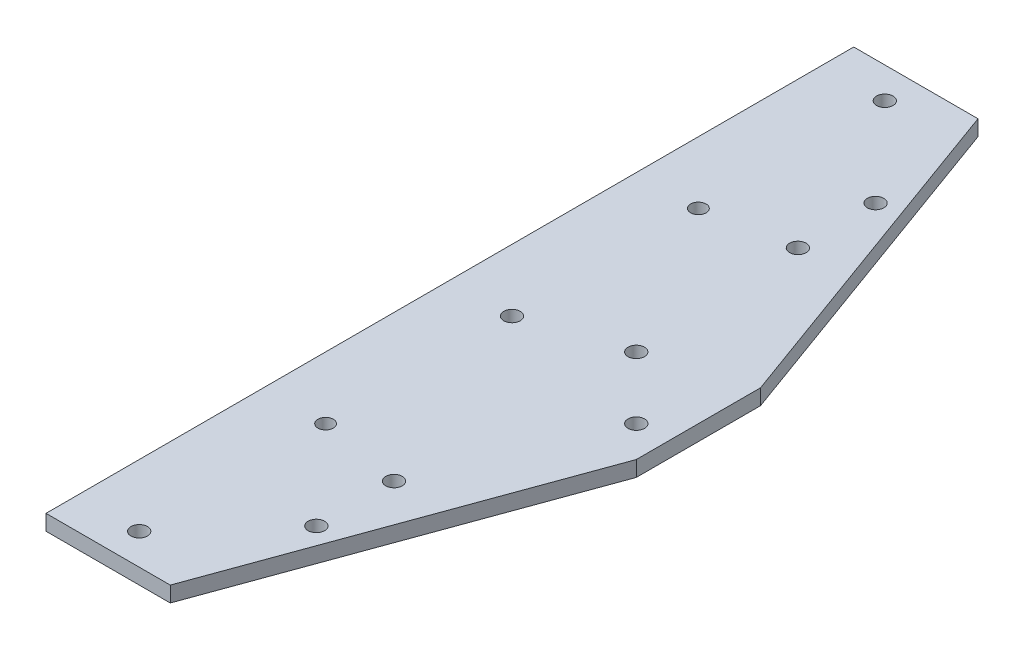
ISO-10303-21;
HEADER;
FILE_DESCRIPTION(('STEP AP214'),'2;1');
FILE_NAME('part.step','',(''),(''),'','','');
FILE_SCHEMA(('AUTOMOTIVE_DESIGN { 1 0 10303 214 1 1 1 1 }'));
ENDSEC;
DATA;
#1=APPLICATION_CONTEXT('core data for automotive mechanical design processes');
#2=APPLICATION_PROTOCOL_DEFINITION('international standard','automotive_design',2000,#1);
#3=PRODUCT_CONTEXT('',#1,'mechanical');
#4=PRODUCT('Part','Part','',(#3));
#5=PRODUCT_RELATED_PRODUCT_CATEGORY('part','',(#4));
#6=PRODUCT_DEFINITION_FORMATION('','',#4);
#7=PRODUCT_DEFINITION_CONTEXT('part definition',#1,'design');
#8=PRODUCT_DEFINITION('design','',#6,#7);
#9=PRODUCT_DEFINITION_SHAPE('','',#8);
#10=(LENGTH_UNIT() NAMED_UNIT(*) SI_UNIT(.MILLI.,.METRE.));
#11=(NAMED_UNIT(*) PLANE_ANGLE_UNIT() SI_UNIT($,.RADIAN.));
#12=(NAMED_UNIT(*) SI_UNIT($,.STERADIAN.) SOLID_ANGLE_UNIT());
#13=UNCERTAINTY_MEASURE_WITH_UNIT(LENGTH_MEASURE(1.E-05),#10,'distance_accuracy_value','');
#14=(GEOMETRIC_REPRESENTATION_CONTEXT(3) GLOBAL_UNCERTAINTY_ASSIGNED_CONTEXT((#13)) GLOBAL_UNIT_ASSIGNED_CONTEXT((#10,
#11,#12)) REPRESENTATION_CONTEXT('',''));
#15=CARTESIAN_POINT('',(0.,0.,0.));
#16=DIRECTION('',(0.,0.,1.));
#17=DIRECTION('',(1.,0.,0.));
#18=AXIS2_PLACEMENT_3D('',#15,#16,#17);
#19=CARTESIAN_POINT('',(0.,6.35,139.7));
#20=DIRECTION('',(0.,1.,0.));
#21=DIRECTION('',(0.,0.,1.));
#22=AXIS2_PLACEMENT_3D('',#19,#20,#21);
#23=PLANE('',#22);
#24=CARTESIAN_POINT('',(59.7232209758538,6.35,57.15));
#25=DIRECTION('',(0.,1.,0.));
#26=DIRECTION('',(0.,0.,-1.));
#27=AXIS2_PLACEMENT_3D('',#24,#25,#26);
#28=CIRCLE('',#27,3.37312);
#29=CARTESIAN_POINT('',(59.7232209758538,6.35,53.77688));
#30=VERTEX_POINT('',#29);
#31=EDGE_CURVE('E205',#30,#30,#28,.T.);
#32=ORIENTED_EDGE('',*,*,#31,.F.);
#33=EDGE_LOOP('',(#32));
#34=FACE_BOUND('',#33,.T.);
#35=CARTESIAN_POINT('',(25.4,6.35,50.8));
#36=DIRECTION('',(0.,1.,0.));
#37=DIRECTION('',(0.,0.,1.));
#38=AXIS2_PLACEMENT_3D('',#35,#36,#37);
#39=CIRCLE('',#38,3.154378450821);
#40=CARTESIAN_POINT('',(25.4,6.35,53.954378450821));
#41=VERTEX_POINT('',#40);
#42=EDGE_CURVE('E199',#41,#41,#39,.T.);
#43=ORIENTED_EDGE('',*,*,#42,.F.);
#44=EDGE_LOOP('',(#43));
#45=FACE_BOUND('',#44,.T.);
#46=CARTESIAN_POINT('',(59.7232209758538,6.35,88.9));
#47=DIRECTION('',(0.,1.,0.));
#48=DIRECTION('',(0.,0.,-1.));
#49=AXIS2_PLACEMENT_3D('',#46,#47,#48);
#50=CIRCLE('',#49,3.37312000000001);
#51=CARTESIAN_POINT('',(59.7232209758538,6.35,85.52688));
#52=VERTEX_POINT('',#51);
#53=EDGE_CURVE('E193',#52,#52,#50,.T.);
#54=ORIENTED_EDGE('',*,*,#53,.F.);
#55=EDGE_LOOP('',(#54));
#56=FACE_BOUND('',#55,.T.);
#57=CARTESIAN_POINT('',(59.7232209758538,6.35,-139.7));
#58=DIRECTION('',(0.,1.,0.));
#59=DIRECTION('',(0.,0.,1.));
#60=AXIS2_PLACEMENT_3D('',#57,#58,#59);
#61=CIRCLE('',#60,3.37312000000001);
#62=CARTESIAN_POINT('',(59.7232209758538,6.35,-136.32688));
#63=VERTEX_POINT('',#62);
#64=EDGE_CURVE('E187',#63,#63,#61,.T.);
#65=ORIENTED_EDGE('',*,*,#64,.F.);
#66=EDGE_LOOP('',(#65));
#67=FACE_BOUND('',#66,.T.);
#68=CARTESIAN_POINT('',(25.4,6.35,-101.6));
#69=DIRECTION('',(0.,1.,0.));
#70=DIRECTION('',(0.,0.,-1.));
#71=AXIS2_PLACEMENT_3D('',#68,#69,#70);
#72=CIRCLE('',#71,3.154378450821);
#73=CARTESIAN_POINT('',(25.4,6.35,-104.754378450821));
#74=VERTEX_POINT('',#73);
#75=EDGE_CURVE('E181',#74,#74,#72,.T.);
#76=ORIENTED_EDGE('',*,*,#75,.F.);
#77=EDGE_LOOP('',(#76));
#78=FACE_BOUND('',#77,.T.);
#79=CARTESIAN_POINT('',(59.7232209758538,6.35,-107.95));
#80=DIRECTION('',(0.,1.,0.));
#81=DIRECTION('',(0.,0.,1.));
#82=AXIS2_PLACEMENT_3D('',#79,#80,#81);
#83=CIRCLE('',#82,3.37312000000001);
#84=CARTESIAN_POINT('',(59.7232209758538,6.35,-104.57688));
#85=VERTEX_POINT('',#84);
#86=EDGE_CURVE('E175',#85,#85,#83,.T.);
#87=ORIENTED_EDGE('',*,*,#86,.F.);
#88=EDGE_LOOP('',(#87));
#89=FACE_BOUND('',#88,.T.);
#90=CARTESIAN_POINT('',(63.4999999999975,6.35,-38.1010753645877));
#91=DIRECTION('',(0.,1.,0.));
#92=DIRECTION('',(0.,0.,1.));
#93=AXIS2_PLACEMENT_3D('',#90,#91,#92);
#94=CIRCLE('',#93,3.37312);
#95=CARTESIAN_POINT('',(63.4999999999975,6.35,-34.7279553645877));
#96=VERTEX_POINT('',#95);
#97=EDGE_CURVE('E160',#96,#96,#94,.T.);
#98=ORIENTED_EDGE('',*,*,#97,.F.);
#99=EDGE_LOOP('',(#98));
#100=FACE_BOUND('',#99,.T.);
#101=CARTESIAN_POINT('',(25.4,6.35,-177.8));
#102=DIRECTION('',(0.,1.,0.));
#103=DIRECTION('',(0.,0.,1.));
#104=AXIS2_PLACEMENT_3D('',#101,#102,#103);
#105=CIRCLE('',#104,3.37311999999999);
#106=CARTESIAN_POINT('',(25.4,6.35,-174.42688));
#107=VERTEX_POINT('',#106);
#108=EDGE_CURVE('E148',#107,#107,#105,.T.);
#109=ORIENTED_EDGE('',*,*,#108,.F.);
#110=EDGE_LOOP('',(#109));
#111=FACE_BOUND('',#110,.T.);
#112=DIRECTION('',(0.,0.,1.));
#113=VECTOR('',#112,1.);
#114=CARTESIAN_POINT('',(0.,6.35,0.));
#115=LINE('',#114,#113);
#116=CARTESIAN_POINT('',(0.,6.35,-190.5));
#117=VERTEX_POINT('',#116);
#118=CARTESIAN_POINT('',(0.,6.35,139.7));
#119=VERTEX_POINT('',#118);
#120=EDGE_CURVE('E47',#117,#119,#115,.T.);
#121=ORIENTED_EDGE('',*,*,#120,.T.);
#122=DIRECTION('',(1.,0.,0.));
#123=VECTOR('',#122,1.);
#124=CARTESIAN_POINT('',(0.,6.35,139.7));
#125=LINE('',#124,#123);
#126=CARTESIAN_POINT('',(50.8,6.35,139.7));
#127=VERTEX_POINT('',#126);
#128=EDGE_CURVE('E141',#119,#127,#125,.T.);
#129=ORIENTED_EDGE('',*,*,#128,.T.);
#130=DIRECTION('',(0.341743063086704,0.,-0.939793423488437));
#131=VECTOR('',#130,1.);
#132=CARTESIAN_POINT('',(101.6,6.35,0.));
#133=LINE('',#132,#131);
#134=CARTESIAN_POINT('',(101.6,6.35,0.));
#135=VERTEX_POINT('',#134);
#136=EDGE_CURVE('E96',#127,#135,#133,.T.);
#137=ORIENTED_EDGE('',*,*,#136,.T.);
#138=DIRECTION('',(0.,0.,-1.));
#139=VECTOR('',#138,1.);
#140=CARTESIAN_POINT('',(101.6,6.35,0.));
#141=LINE('',#140,#139);
#142=CARTESIAN_POINT('',(101.6,6.35,-50.8));
#143=VERTEX_POINT('',#142);
#144=EDGE_CURVE('E90',#135,#143,#141,.T.);
#145=ORIENTED_EDGE('',*,*,#144,.T.);
#146=DIRECTION('',(-0.341743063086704,0.,-0.939793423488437));
#147=VECTOR('',#146,1.);
#148=CARTESIAN_POINT('',(101.6,6.35,-50.8));
#149=LINE('',#148,#147);
#150=CARTESIAN_POINT('',(50.8,6.35,-190.5));
#151=VERTEX_POINT('',#150);
#152=EDGE_CURVE('E94',#143,#151,#149,.T.);
#153=ORIENTED_EDGE('',*,*,#152,.T.);
#154=DIRECTION('',(-1.,0.,0.));
#155=VECTOR('',#154,1.);
#156=CARTESIAN_POINT('',(0.,6.35,-190.5));
#157=LINE('',#156,#155);
#158=EDGE_CURVE('E110',#151,#117,#157,.T.);
#159=ORIENTED_EDGE('',*,*,#158,.T.);
#160=EDGE_LOOP('',(#121,#129,#137,#145,#153,#159));
#161=FACE_BOUND('',#160,.T.);
#162=CARTESIAN_POINT('',(88.8999999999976,6.35,-12.7010753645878));
#163=DIRECTION('',(0.,1.,0.));
#164=DIRECTION('',(0.,0.,1.));
#165=AXIS2_PLACEMENT_3D('',#162,#163,#164);
#166=CIRCLE('',#165,3.37312);
#167=CARTESIAN_POINT('',(88.8999999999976,6.35,-9.32795536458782));
#168=VERTEX_POINT('',#167);
#169=EDGE_CURVE('E119',#168,#168,#166,.T.);
#170=ORIENTED_EDGE('',*,*,#169,.F.);
#171=EDGE_LOOP('',(#170));
#172=FACE_BOUND('',#171,.T.);
#173=CARTESIAN_POINT('',(25.4,6.35,127.));
#174=DIRECTION('',(0.,1.,0.));
#175=DIRECTION('',(0.,0.,-1.));
#176=AXIS2_PLACEMENT_3D('',#173,#174,#175);
#177=CIRCLE('',#176,3.37311999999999);
#178=CARTESIAN_POINT('',(25.4,6.35,123.62688));
#179=VERTEX_POINT('',#178);
#180=EDGE_CURVE('E154',#179,#179,#177,.T.);
#181=ORIENTED_EDGE('',*,*,#180,.F.);
#182=EDGE_LOOP('',(#181));
#183=FACE_BOUND('',#182,.T.);
#184=CARTESIAN_POINT('',(25.4,6.35,-25.4));
#185=DIRECTION('',(0.,1.,0.));
#186=DIRECTION('',(0.,0.,1.));
#187=AXIS2_PLACEMENT_3D('',#184,#185,#186);
#188=CIRCLE('',#187,3.37312);
#189=CARTESIAN_POINT('',(25.4,6.35,-22.02688));
#190=VERTEX_POINT('',#189);
#191=EDGE_CURVE('E166',#190,#190,#188,.T.);
#192=ORIENTED_EDGE('',*,*,#191,.F.);
#193=EDGE_LOOP('',(#192));
#194=FACE_BOUND('',#193,.T.);
#195=ADVANCED_FACE('F30',(#34,#45,#56,#67,#78,#89,#100,#111,#161,#172,#183,#194),#23,.T.);
#196=CARTESIAN_POINT('',(0.,0.,139.7));
#197=DIRECTION('',(0.,1.,0.));
#198=DIRECTION('',(0.,0.,1.));
#199=AXIS2_PLACEMENT_3D('',#196,#197,#198);
#200=PLANE('',#199);
#201=CARTESIAN_POINT('',(59.7232209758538,0.,57.15));
#202=DIRECTION('',(0.,1.,0.));
#203=DIRECTION('',(0.,0.,-1.));
#204=AXIS2_PLACEMENT_3D('',#201,#202,#203);
#205=CIRCLE('',#204,3.37312);
#206=CARTESIAN_POINT('',(59.7232209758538,0.,53.77688));
#207=VERTEX_POINT('',#206);
#208=EDGE_CURVE('E202',#207,#207,#205,.T.);
#209=ORIENTED_EDGE('',*,*,#208,.T.);
#210=EDGE_LOOP('',(#209));
#211=FACE_BOUND('',#210,.T.);
#212=CARTESIAN_POINT('',(25.4,0.,50.8));
#213=DIRECTION('',(0.,1.,0.));
#214=DIRECTION('',(0.,0.,1.));
#215=AXIS2_PLACEMENT_3D('',#212,#213,#214);
#216=CIRCLE('',#215,3.154378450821);
#217=CARTESIAN_POINT('',(25.4,0.,53.954378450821));
#218=VERTEX_POINT('',#217);
#219=EDGE_CURVE('E196',#218,#218,#216,.T.);
#220=ORIENTED_EDGE('',*,*,#219,.T.);
#221=EDGE_LOOP('',(#220));
#222=FACE_BOUND('',#221,.T.);
#223=CARTESIAN_POINT('',(59.7232209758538,0.,88.9));
#224=DIRECTION('',(0.,1.,0.));
#225=DIRECTION('',(0.,0.,-1.));
#226=AXIS2_PLACEMENT_3D('',#223,#224,#225);
#227=CIRCLE('',#226,3.37312000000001);
#228=CARTESIAN_POINT('',(59.7232209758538,0.,85.52688));
#229=VERTEX_POINT('',#228);
#230=EDGE_CURVE('E190',#229,#229,#227,.T.);
#231=ORIENTED_EDGE('',*,*,#230,.T.);
#232=EDGE_LOOP('',(#231));
#233=FACE_BOUND('',#232,.T.);
#234=CARTESIAN_POINT('',(59.7232209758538,0.,-139.7));
#235=DIRECTION('',(0.,1.,0.));
#236=DIRECTION('',(0.,0.,1.));
#237=AXIS2_PLACEMENT_3D('',#234,#235,#236);
#238=CIRCLE('',#237,3.37312000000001);
#239=CARTESIAN_POINT('',(59.7232209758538,0.,-136.32688));
#240=VERTEX_POINT('',#239);
#241=EDGE_CURVE('E184',#240,#240,#238,.T.);
#242=ORIENTED_EDGE('',*,*,#241,.T.);
#243=EDGE_LOOP('',(#242));
#244=FACE_BOUND('',#243,.T.);
#245=CARTESIAN_POINT('',(25.4,0.,-101.6));
#246=DIRECTION('',(0.,1.,0.));
#247=DIRECTION('',(0.,0.,-1.));
#248=AXIS2_PLACEMENT_3D('',#245,#246,#247);
#249=CIRCLE('',#248,3.154378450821);
#250=CARTESIAN_POINT('',(25.4,0.,-104.754378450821));
#251=VERTEX_POINT('',#250);
#252=EDGE_CURVE('E178',#251,#251,#249,.T.);
#253=ORIENTED_EDGE('',*,*,#252,.T.);
#254=EDGE_LOOP('',(#253));
#255=FACE_BOUND('',#254,.T.);
#256=CARTESIAN_POINT('',(59.7232209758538,0.,-107.95));
#257=DIRECTION('',(0.,1.,0.));
#258=DIRECTION('',(0.,0.,1.));
#259=AXIS2_PLACEMENT_3D('',#256,#257,#258);
#260=CIRCLE('',#259,3.37312000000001);
#261=CARTESIAN_POINT('',(59.7232209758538,0.,-104.57688));
#262=VERTEX_POINT('',#261);
#263=EDGE_CURVE('E172',#262,#262,#260,.T.);
#264=ORIENTED_EDGE('',*,*,#263,.T.);
#265=EDGE_LOOP('',(#264));
#266=FACE_BOUND('',#265,.T.);
#267=CARTESIAN_POINT('',(63.4999999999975,0.,-38.1010753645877));
#268=DIRECTION('',(0.,1.,0.));
#269=DIRECTION('',(0.,0.,1.));
#270=AXIS2_PLACEMENT_3D('',#267,#268,#269);
#271=CIRCLE('',#270,3.37312);
#272=CARTESIAN_POINT('',(63.4999999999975,0.,-34.7279553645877));
#273=VERTEX_POINT('',#272);
#274=EDGE_CURVE('E163',#273,#273,#271,.T.);
#275=ORIENTED_EDGE('',*,*,#274,.T.);
#276=EDGE_LOOP('',(#275));
#277=FACE_BOUND('',#276,.T.);
#278=CARTESIAN_POINT('',(25.4,0.,-177.8));
#279=DIRECTION('',(0.,1.,0.));
#280=DIRECTION('',(0.,0.,1.));
#281=AXIS2_PLACEMENT_3D('',#278,#279,#280);
#282=CIRCLE('',#281,3.37311999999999);
#283=CARTESIAN_POINT('',(25.4,0.,-174.42688));
#284=VERTEX_POINT('',#283);
#285=EDGE_CURVE('E151',#284,#284,#282,.T.);
#286=ORIENTED_EDGE('',*,*,#285,.T.);
#287=EDGE_LOOP('',(#286));
#288=FACE_BOUND('',#287,.T.);
#289=DIRECTION('',(1.,0.,0.));
#290=VECTOR('',#289,1.);
#291=CARTESIAN_POINT('',(0.,0.,139.7));
#292=LINE('',#291,#290);
#293=CARTESIAN_POINT('',(0.,0.,139.7));
#294=VERTEX_POINT('',#293);
#295=CARTESIAN_POINT('',(50.8,0.,139.7));
#296=VERTEX_POINT('',#295);
#297=EDGE_CURVE('E116',#294,#296,#292,.T.);
#298=ORIENTED_EDGE('',*,*,#297,.F.);
#299=DIRECTION('',(0.,0.,1.));
#300=VECTOR('',#299,1.);
#301=CARTESIAN_POINT('',(0.,0.,0.));
#302=LINE('',#301,#300);
#303=CARTESIAN_POINT('',(0.,0.,-190.5));
#304=VERTEX_POINT('',#303);
#305=EDGE_CURVE('E78',#304,#294,#302,.T.);
#306=ORIENTED_EDGE('',*,*,#305,.F.);
#307=DIRECTION('',(-1.,0.,0.));
#308=VECTOR('',#307,1.);
#309=CARTESIAN_POINT('',(0.,0.,-190.5));
#310=LINE('',#309,#308);
#311=CARTESIAN_POINT('',(50.8,0.,-190.5));
#312=VERTEX_POINT('',#311);
#313=EDGE_CURVE('E123',#312,#304,#310,.T.);
#314=ORIENTED_EDGE('',*,*,#313,.F.);
#315=DIRECTION('',(-0.341743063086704,0.,-0.939793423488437));
#316=VECTOR('',#315,1.);
#317=CARTESIAN_POINT('',(101.6,0.,-50.8));
#318=LINE('',#317,#316);
#319=CARTESIAN_POINT('',(101.6,0.,-50.8));
#320=VERTEX_POINT('',#319);
#321=EDGE_CURVE('E71',#320,#312,#318,.T.);
#322=ORIENTED_EDGE('',*,*,#321,.F.);
#323=DIRECTION('',(0.,0.,-1.));
#324=VECTOR('',#323,1.);
#325=CARTESIAN_POINT('',(101.6,0.,0.));
#326=LINE('',#325,#324);
#327=CARTESIAN_POINT('',(101.6,0.,0.));
#328=VERTEX_POINT('',#327);
#329=EDGE_CURVE('E104',#328,#320,#326,.T.);
#330=ORIENTED_EDGE('',*,*,#329,.F.);
#331=DIRECTION('',(0.341743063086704,0.,-0.939793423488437));
#332=VECTOR('',#331,1.);
#333=CARTESIAN_POINT('',(101.6,0.,0.));
#334=LINE('',#333,#332);
#335=EDGE_CURVE('E118',#296,#328,#334,.T.);
#336=ORIENTED_EDGE('',*,*,#335,.F.);
#337=EDGE_LOOP('',(#298,#306,#314,#322,#330,#336));
#338=FACE_BOUND('',#337,.T.);
#339=CARTESIAN_POINT('',(88.8999999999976,0.,-12.7010753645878));
#340=DIRECTION('',(0.,1.,0.));
#341=DIRECTION('',(0.,0.,1.));
#342=AXIS2_PLACEMENT_3D('',#339,#340,#341);
#343=CIRCLE('',#342,3.37312);
#344=CARTESIAN_POINT('',(88.8999999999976,0.,-9.32795536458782));
#345=VERTEX_POINT('',#344);
#346=EDGE_CURVE('E145',#345,#345,#343,.T.);
#347=ORIENTED_EDGE('',*,*,#346,.T.);
#348=EDGE_LOOP('',(#347));
#349=FACE_BOUND('',#348,.T.);
#350=CARTESIAN_POINT('',(25.4,0.,127.));
#351=DIRECTION('',(0.,1.,0.));
#352=DIRECTION('',(0.,0.,-1.));
#353=AXIS2_PLACEMENT_3D('',#350,#351,#352);
#354=CIRCLE('',#353,3.37311999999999);
#355=CARTESIAN_POINT('',(25.4,0.,123.62688));
#356=VERTEX_POINT('',#355);
#357=EDGE_CURVE('E157',#356,#356,#354,.T.);
#358=ORIENTED_EDGE('',*,*,#357,.T.);
#359=EDGE_LOOP('',(#358));
#360=FACE_BOUND('',#359,.T.);
#361=CARTESIAN_POINT('',(25.4,0.,-25.4));
#362=DIRECTION('',(0.,1.,0.));
#363=DIRECTION('',(0.,0.,1.));
#364=AXIS2_PLACEMENT_3D('',#361,#362,#363);
#365=CIRCLE('',#364,3.37312);
#366=CARTESIAN_POINT('',(25.4,0.,-22.02688));
#367=VERTEX_POINT('',#366);
#368=EDGE_CURVE('E169',#367,#367,#365,.T.);
#369=ORIENTED_EDGE('',*,*,#368,.T.);
#370=EDGE_LOOP('',(#369));
#371=FACE_BOUND('',#370,.T.);
#372=ADVANCED_FACE('F135',(#211,#222,#233,#244,#255,#266,#277,#288,#338,#349,#360,#371),#200,.F.);
#373=CARTESIAN_POINT('',(0.,6.35,139.7));
#374=DIRECTION('',(0.,0.,-1.));
#375=DIRECTION('',(-1.,0.,0.));
#376=AXIS2_PLACEMENT_3D('',#373,#374,#375);
#377=PLANE('',#376);
#378=ORIENTED_EDGE('',*,*,#297,.T.);
#379=DIRECTION('',(0.,-1.,0.));
#380=VECTOR('',#379,1.);
#381=CARTESIAN_POINT('',(50.8,6.35,139.7));
#382=LINE('',#381,#380);
#383=EDGE_CURVE('E39',#127,#296,#382,.T.);
#384=ORIENTED_EDGE('',*,*,#383,.F.);
#385=ORIENTED_EDGE('',*,*,#128,.F.);
#386=DIRECTION('',(0.,-1.,0.));
#387=VECTOR('',#386,1.);
#388=CARTESIAN_POINT('',(0.,6.35,139.7));
#389=LINE('',#388,#387);
#390=EDGE_CURVE('E11',#119,#294,#389,.T.);
#391=ORIENTED_EDGE('',*,*,#390,.T.);
#392=EDGE_LOOP('',(#378,#384,#385,#391));
#393=FACE_BOUND('',#392,.T.);
#394=ADVANCED_FACE('F32',(#393),#377,.F.);
#395=CARTESIAN_POINT('',(101.6,6.35,0.));
#396=DIRECTION('',(-0.939793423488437,0.,-0.341743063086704));
#397=DIRECTION('',(-0.341743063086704,0.,0.939793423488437));
#398=AXIS2_PLACEMENT_3D('',#395,#396,#397);
#399=PLANE('',#398);
#400=ORIENTED_EDGE('',*,*,#335,.T.);
#401=DIRECTION('',(0.,-1.,0.));
#402=VECTOR('',#401,1.);
#403=CARTESIAN_POINT('',(101.6,6.35,0.));
#404=LINE('',#403,#402);
#405=EDGE_CURVE('E105',#135,#328,#404,.T.);
#406=ORIENTED_EDGE('',*,*,#405,.F.);
#407=ORIENTED_EDGE('',*,*,#136,.F.);
#408=ORIENTED_EDGE('',*,*,#383,.T.);
#409=EDGE_LOOP('',(#400,#406,#407,#408));
#410=FACE_BOUND('',#409,.T.);
#411=ADVANCED_FACE('F132',(#410),#399,.F.);
#412=CARTESIAN_POINT('',(101.6,6.35,0.));
#413=DIRECTION('',(-1.,0.,0.));
#414=DIRECTION('',(0.,0.,1.));
#415=AXIS2_PLACEMENT_3D('',#412,#413,#414);
#416=PLANE('',#415);
#417=ORIENTED_EDGE('',*,*,#329,.T.);
#418=DIRECTION('',(0.,-1.,0.));
#419=VECTOR('',#418,1.);
#420=CARTESIAN_POINT('',(101.6,6.35,-50.8));
#421=LINE('',#420,#419);
#422=EDGE_CURVE('E101',#143,#320,#421,.T.);
#423=ORIENTED_EDGE('',*,*,#422,.F.);
#424=ORIENTED_EDGE('',*,*,#144,.F.);
#425=ORIENTED_EDGE('',*,*,#405,.T.);
#426=EDGE_LOOP('',(#417,#423,#424,#425));
#427=FACE_BOUND('',#426,.T.);
#428=ADVANCED_FACE('F102',(#427),#416,.F.);
#429=CARTESIAN_POINT('',(101.6,6.35,-50.8));
#430=DIRECTION('',(-0.939793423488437,0.,0.341743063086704));
#431=DIRECTION('',(0.341743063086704,0.,0.939793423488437));
#432=AXIS2_PLACEMENT_3D('',#429,#430,#431);
#433=PLANE('',#432);
#434=ORIENTED_EDGE('',*,*,#321,.T.);
#435=DIRECTION('',(0.,-1.,0.));
#436=VECTOR('',#435,1.);
#437=CARTESIAN_POINT('',(50.8,6.35,-190.5));
#438=LINE('',#437,#436);
#439=EDGE_CURVE('E106',#151,#312,#438,.T.);
#440=ORIENTED_EDGE('',*,*,#439,.F.);
#441=ORIENTED_EDGE('',*,*,#152,.F.);
#442=ORIENTED_EDGE('',*,*,#422,.T.);
#443=EDGE_LOOP('',(#434,#440,#441,#442));
#444=FACE_BOUND('',#443,.T.);
#445=ADVANCED_FACE('F108',(#444),#433,.F.);
#446=CARTESIAN_POINT('',(0.,6.35,-190.5));
#447=DIRECTION('',(0.,0.,1.));
#448=DIRECTION('',(1.,0.,0.));
#449=AXIS2_PLACEMENT_3D('',#446,#447,#448);
#450=PLANE('',#449);
#451=ORIENTED_EDGE('',*,*,#313,.T.);
#452=DIRECTION('',(0.,-1.,0.));
#453=VECTOR('',#452,1.);
#454=CARTESIAN_POINT('',(0.,6.35,-190.5));
#455=LINE('',#454,#453);
#456=EDGE_CURVE('E112',#117,#304,#455,.T.);
#457=ORIENTED_EDGE('',*,*,#456,.F.);
#458=ORIENTED_EDGE('',*,*,#158,.F.);
#459=ORIENTED_EDGE('',*,*,#439,.T.);
#460=EDGE_LOOP('',(#451,#457,#458,#459));
#461=FACE_BOUND('',#460,.T.);
#462=ADVANCED_FACE('F139',(#461),#450,.F.);
#463=CARTESIAN_POINT('',(0.,6.35,0.));
#464=DIRECTION('',(1.,0.,0.));
#465=DIRECTION('',(0.,0.,-1.));
#466=AXIS2_PLACEMENT_3D('',#463,#464,#465);
#467=PLANE('',#466);
#468=ORIENTED_EDGE('',*,*,#305,.T.);
#469=ORIENTED_EDGE('',*,*,#390,.F.);
#470=ORIENTED_EDGE('',*,*,#120,.F.);
#471=ORIENTED_EDGE('',*,*,#456,.T.);
#472=EDGE_LOOP('',(#468,#469,#470,#471));
#473=FACE_BOUND('',#472,.T.);
#474=ADVANCED_FACE('F140',(#473),#467,.F.);
#475=CARTESIAN_POINT('',(88.8999999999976,6.35,-12.7010753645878));
#476=DIRECTION('',(0.,-1.,0.));
#477=DIRECTION('',(0.,0.,-1.));
#478=AXIS2_PLACEMENT_3D('',#475,#476,#477);
#479=CYLINDRICAL_SURFACE('',#478,3.37312);
#480=ORIENTED_EDGE('',*,*,#169,.T.);
#481=EDGE_LOOP('',(#480));
#482=FACE_BOUND('',#481,.T.);
#483=ORIENTED_EDGE('',*,*,#346,.F.);
#484=EDGE_LOOP('',(#483));
#485=FACE_BOUND('',#484,.T.);
#486=ADVANCED_FACE('F241',(#482,#485),#479,.F.);
#487=CARTESIAN_POINT('',(25.4,6.35,-177.8));
#488=DIRECTION('',(0.,-1.,0.));
#489=DIRECTION('',(0.,0.,-1.));
#490=AXIS2_PLACEMENT_3D('',#487,#488,#489);
#491=CYLINDRICAL_SURFACE('',#490,3.37311999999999);
#492=ORIENTED_EDGE('',*,*,#108,.T.);
#493=EDGE_LOOP('',(#492));
#494=FACE_BOUND('',#493,.T.);
#495=ORIENTED_EDGE('',*,*,#285,.F.);
#496=EDGE_LOOP('',(#495));
#497=FACE_BOUND('',#496,.T.);
#498=ADVANCED_FACE('F237',(#494,#497),#491,.F.);
#499=CARTESIAN_POINT('',(25.4,6.35,127.));
#500=DIRECTION('',(0.,-1.,0.));
#501=DIRECTION('',(0.,0.,-1.));
#502=AXIS2_PLACEMENT_3D('',#499,#500,#501);
#503=CYLINDRICAL_SURFACE('',#502,3.37311999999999);
#504=ORIENTED_EDGE('',*,*,#180,.T.);
#505=EDGE_LOOP('',(#504));
#506=FACE_BOUND('',#505,.T.);
#507=ORIENTED_EDGE('',*,*,#357,.F.);
#508=EDGE_LOOP('',(#507));
#509=FACE_BOUND('',#508,.T.);
#510=ADVANCED_FACE('F240',(#506,#509),#503,.F.);
#511=CARTESIAN_POINT('',(63.4999999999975,6.35,-38.1010753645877));
#512=DIRECTION('',(0.,-1.,0.));
#513=DIRECTION('',(0.,0.,-1.));
#514=AXIS2_PLACEMENT_3D('',#511,#512,#513);
#515=CYLINDRICAL_SURFACE('',#514,3.37312);
#516=ORIENTED_EDGE('',*,*,#97,.T.);
#517=EDGE_LOOP('',(#516));
#518=FACE_BOUND('',#517,.T.);
#519=ORIENTED_EDGE('',*,*,#274,.F.);
#520=EDGE_LOOP('',(#519));
#521=FACE_BOUND('',#520,.T.);
#522=ADVANCED_FACE('F296',(#518,#521),#515,.F.);
#523=CARTESIAN_POINT('',(25.4,6.35,-25.4));
#524=DIRECTION('',(0.,-1.,0.));
#525=DIRECTION('',(0.,0.,-1.));
#526=AXIS2_PLACEMENT_3D('',#523,#524,#525);
#527=CYLINDRICAL_SURFACE('',#526,3.37312);
#528=ORIENTED_EDGE('',*,*,#191,.T.);
#529=EDGE_LOOP('',(#528));
#530=FACE_BOUND('',#529,.T.);
#531=ORIENTED_EDGE('',*,*,#368,.F.);
#532=EDGE_LOOP('',(#531));
#533=FACE_BOUND('',#532,.T.);
#534=ADVANCED_FACE('F304',(#530,#533),#527,.F.);
#535=CARTESIAN_POINT('',(59.7232209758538,0.,-107.95));
#536=DIRECTION('',(0.,1.,0.));
#537=DIRECTION('',(0.,0.,1.));
#538=AXIS2_PLACEMENT_3D('',#535,#536,#537);
#539=CYLINDRICAL_SURFACE('',#538,3.37312000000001);
#540=ORIENTED_EDGE('',*,*,#263,.F.);
#541=EDGE_LOOP('',(#540));
#542=FACE_BOUND('',#541,.T.);
#543=ORIENTED_EDGE('',*,*,#86,.T.);
#544=EDGE_LOOP('',(#543));
#545=FACE_BOUND('',#544,.T.);
#546=ADVANCED_FACE('F312',(#542,#545),#539,.F.);
#547=CARTESIAN_POINT('',(25.4,0.,-101.6));
#548=DIRECTION('',(0.,1.,0.));
#549=DIRECTION('',(0.,0.,1.));
#550=AXIS2_PLACEMENT_3D('',#547,#548,#549);
#551=CYLINDRICAL_SURFACE('',#550,3.154378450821);
#552=ORIENTED_EDGE('',*,*,#252,.F.);
#553=EDGE_LOOP('',(#552));
#554=FACE_BOUND('',#553,.T.);
#555=ORIENTED_EDGE('',*,*,#75,.T.);
#556=EDGE_LOOP('',(#555));
#557=FACE_BOUND('',#556,.T.);
#558=ADVANCED_FACE('F321',(#554,#557),#551,.F.);
#559=CARTESIAN_POINT('',(59.7232209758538,0.,-139.7));
#560=DIRECTION('',(0.,1.,0.));
#561=DIRECTION('',(0.,0.,1.));
#562=AXIS2_PLACEMENT_3D('',#559,#560,#561);
#563=CYLINDRICAL_SURFACE('',#562,3.37312000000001);
#564=ORIENTED_EDGE('',*,*,#241,.F.);
#565=EDGE_LOOP('',(#564));
#566=FACE_BOUND('',#565,.T.);
#567=ORIENTED_EDGE('',*,*,#64,.T.);
#568=EDGE_LOOP('',(#567));
#569=FACE_BOUND('',#568,.T.);
#570=ADVANCED_FACE('F329',(#566,#569),#563,.F.);
#571=CARTESIAN_POINT('',(59.7232209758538,0.,88.9));
#572=DIRECTION('',(0.,1.,0.));
#573=DIRECTION('',(0.,0.,1.));
#574=AXIS2_PLACEMENT_3D('',#571,#572,#573);
#575=CYLINDRICAL_SURFACE('',#574,3.37312000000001);
#576=ORIENTED_EDGE('',*,*,#230,.F.);
#577=EDGE_LOOP('',(#576));
#578=FACE_BOUND('',#577,.T.);
#579=ORIENTED_EDGE('',*,*,#53,.T.);
#580=EDGE_LOOP('',(#579));
#581=FACE_BOUND('',#580,.T.);
#582=ADVANCED_FACE('F337',(#578,#581),#575,.F.);
#583=CARTESIAN_POINT('',(25.4,0.,50.8));
#584=DIRECTION('',(0.,1.,0.));
#585=DIRECTION('',(0.,0.,1.));
#586=AXIS2_PLACEMENT_3D('',#583,#584,#585);
#587=CYLINDRICAL_SURFACE('',#586,3.154378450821);
#588=ORIENTED_EDGE('',*,*,#219,.F.);
#589=EDGE_LOOP('',(#588));
#590=FACE_BOUND('',#589,.T.);
#591=ORIENTED_EDGE('',*,*,#42,.T.);
#592=EDGE_LOOP('',(#591));
#593=FACE_BOUND('',#592,.T.);
#594=ADVANCED_FACE('F216',(#590,#593),#587,.F.);
#595=CARTESIAN_POINT('',(59.7232209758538,0.,57.15));
#596=DIRECTION('',(0.,1.,0.));
#597=DIRECTION('',(0.,0.,1.));
#598=AXIS2_PLACEMENT_3D('',#595,#596,#597);
#599=CYLINDRICAL_SURFACE('',#598,3.37312);
#600=ORIENTED_EDGE('',*,*,#208,.F.);
#601=EDGE_LOOP('',(#600));
#602=FACE_BOUND('',#601,.T.);
#603=ORIENTED_EDGE('',*,*,#31,.T.);
#604=EDGE_LOOP('',(#603));
#605=FACE_BOUND('',#604,.T.);
#606=ADVANCED_FACE('F213',(#602,#605),#599,.F.);
#607=CLOSED_SHELL('',(#195,#372,#394,#411,#428,#445,#462,#474,#486,#498,#510,#522,#534,#546,
#558,#570,#582,#594,#606));
#608=MANIFOLD_SOLID_BREP('B2',#607);
#609=ADVANCED_BREP_SHAPE_REPRESENTATION('',(#18,#608),#14);
#610=SHAPE_DEFINITION_REPRESENTATION(#9,#609);
ENDSEC;
END-ISO-10303-21;
